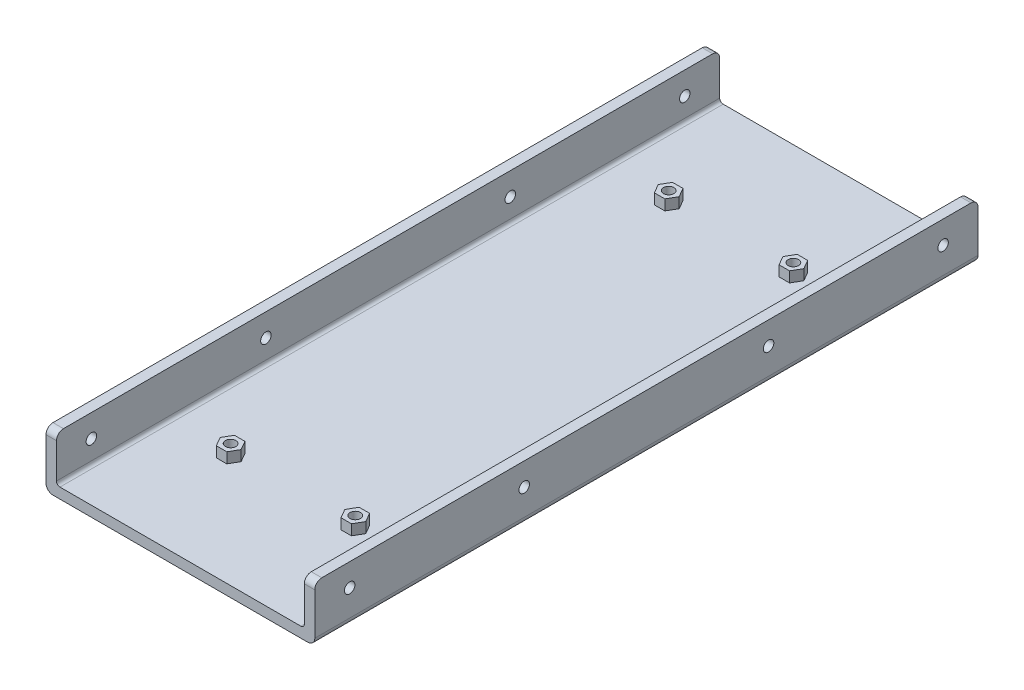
from build123d import *

# Parameters (mm, degrees)
EXTRUDE_1_DEPTH     = 190
FILLET_1_R          = 2
FILLET_2_R          = 1
CUT_EXTRUDE_1_REACH = 209.392
SKETCH_10_R         = 1.5
SKETCH_12_R         = 1.5
EXTRUDE_3_DEPTH     = 3
CUT_EXTRUDE_START   = -33
SKETCH_14_R         = 1.5
CUT_EXTRUDE_3_DEPTH = 33
FILLET_3_R          = 2


with BuildPart() as part:
    # Sketch 7 → Extrude 1 (new body)
    with BuildSketch(Plane.XY):
        Polygon((49.522641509, -31.340644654), (49.522641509, -15.340644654), (46.522641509, -15.340644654), (46.522641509, -28.340644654), (-24.477358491, -28.340644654), (-24.477358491, -15.340644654), (-27.477358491, -15.340644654), (-27.477358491, -31.340644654), align=None)
    extrude(amount=EXTRUDE_1_DEPTH)

    # Fillet 1
    fillet_1_edges = [part.edges().sort_by_distance(p)[0] for p in [
        (-27.477358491, -31.340644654, 95),
        (49.522641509, -31.340644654, 95),
    ]]
    fillet(fillet_1_edges, radius=FILLET_1_R)

    # Fillet 2
    fillet_2_edges = [part.edges().sort_by_distance(p)[0] for p in [
        (-24.477358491, -28.340644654, 95),
        (46.522641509, -28.340644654, 95),
    ]]
    fillet(fillet_2_edges, radius=FILLET_2_R)

    # Cut-Extrude 1: up to this face of the body (flat: up to its plane)
    cut_extrude_1_end = Plane(part.part.faces().sort_by_distance((-27.477358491, -22.340644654, 95))[0])
    # Sketch 10 → Cut-Extrude 1 (cut, up to the picked face)
    with BuildSketch(Plane.ZY.offset(-49.522641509), mode=Mode.PRIVATE) as cut_extrude_1_sk1:
        with Locations(Location((10, -21.840644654, 0), (0, 0, 180))):
            Circle(SKETCH_10_R)
    cut_extrude_1_tool1 = split(extrude(cut_extrude_1_sk1.sketch, amount=CUT_EXTRUDE_1_REACH, mode=Mode.PRIVATE), bisect_by=cut_extrude_1_end, keep=Keep.BOTH, mode=Mode.PRIVATE)
    # Sketch 10 → Cut-Extrude 1 (cut, up to the picked face)
    with BuildSketch(Plane.ZY.offset(-49.522641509), mode=Mode.PRIVATE) as cut_extrude_1_sk2:
        with Locations(Location((60, -21.840644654, 0), (0, 0, 180))):
            Circle(SKETCH_10_R)
    cut_extrude_1_tool2 = split(extrude(cut_extrude_1_sk2.sketch, amount=CUT_EXTRUDE_1_REACH, mode=Mode.PRIVATE), bisect_by=cut_extrude_1_end, keep=Keep.BOTH, mode=Mode.PRIVATE)
    # Sketch 10 → Cut-Extrude 1 (cut, up to the picked face)
    with BuildSketch(Plane.ZY.offset(-49.522641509), mode=Mode.PRIVATE) as cut_extrude_1_sk3:
        with Locations(Location((130, -21.840644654, 0), (0, 0, 180))):
            Circle(SKETCH_10_R)
    cut_extrude_1_tool3 = split(extrude(cut_extrude_1_sk3.sketch, amount=CUT_EXTRUDE_1_REACH, mode=Mode.PRIVATE), bisect_by=cut_extrude_1_end, keep=Keep.BOTH, mode=Mode.PRIVATE)
    # Sketch 10 → Cut-Extrude 1 (cut, up to the picked face)
    with BuildSketch(Plane.ZY.offset(-49.522641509), mode=Mode.PRIVATE) as cut_extrude_1_sk4:
        with Locations(Location((180, -21.840644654, 0), (0, 0, 180))):
            Circle(SKETCH_10_R)
    cut_extrude_1_tool4 = split(extrude(cut_extrude_1_sk4.sketch, amount=CUT_EXTRUDE_1_REACH, mode=Mode.PRIVATE), bisect_by=cut_extrude_1_end, keep=Keep.BOTH, mode=Mode.PRIVATE)
    add(cut_extrude_1_tool1.solids().sort_by(Axis((49.522642, -21.840645, 10), (-1, 0, 0)))[0], mode=Mode.SUBTRACT)
    add(cut_extrude_1_tool2.solids().sort_by(Axis((49.522642, -21.840645, 60), (-1, 0, 0)))[0], mode=Mode.SUBTRACT)
    add(cut_extrude_1_tool3.solids().sort_by(Axis((49.522642, -21.840645, 130), (-1, 0, 0)))[0], mode=Mode.SUBTRACT)
    add(cut_extrude_1_tool4.solids().sort_by(Axis((49.522642, -21.840645, 180), (-1, 0, 0)))[0], mode=Mode.SUBTRACT)

    # Sketch 12 → Extrude 3 (add)
    # profile 1 of 4: a face of its own
    with BuildSketch(Plane(origin=(0, -28.340644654, 0), x_dir=(1, 0, 0), z_dir=(0, 1, 0))):
        Polygon((25.882256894, -157.75), (27.382256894, -160.348076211), (30.382256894, -160.348076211), (31.882256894, -157.75), (30.382256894, -155.151923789), (27.382256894, -155.151923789), align=None)
        with Locations(Location((28.882256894, -157.75, 0), (0, 0, 270))):
            Circle(SKETCH_12_R, mode=Mode.SUBTRACT)
    # profile 2 of 4: a face of its own
    with BuildSketch(Plane(origin=(0, -28.340644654, 0), x_dir=(1, 0, 0), z_dir=(0, 1, 0))):
        Polygon((-5.336973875, -155.151923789), (-3.836973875, -157.75), (-5.336973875, -160.348076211), (-8.336973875, -160.348076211), (-9.836973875, -157.75), (-8.336973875, -155.151923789), align=None)
        with Locations(Location((-6.836973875, -157.75, 0), (0, 0, 90))):
            Circle(SKETCH_12_R, mode=Mode.SUBTRACT)
    # profile 3 of 4: a face of its own
    with BuildSketch(Plane(origin=(0, -28.340644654, 0), x_dir=(1, 0, 0), z_dir=(0, 1, 0))):
        Polygon((-3.836973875, -32.25), (-5.336973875, -29.651923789), (-8.336973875, -29.651923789), (-9.836973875, -32.25), (-8.336973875, -34.848076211), (-5.336973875, -34.848076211), align=None)
        with Locations(Location((-6.836973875, -32.25, 0), (0, 0, 270))):
            Circle(SKETCH_12_R, mode=Mode.SUBTRACT)
    # profile 4 of 4: a face of its own
    with BuildSketch(Plane(origin=(0, -28.340644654, 0), x_dir=(1, 0, 0), z_dir=(0, 1, 0))):
        Polygon((27.382256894, -34.848076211), (25.882256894, -32.25), (27.382256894, -29.651923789), (30.382256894, -29.651923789), (31.882256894, -32.25), (30.382256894, -34.848076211), align=None)
        with Locations(Location((28.882256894, -32.25, 0), (0, 0, 90))):
            Circle(SKETCH_12_R, mode=Mode.SUBTRACT)
    extrude(amount=EXTRUDE_3_DEPTH)

    # Sketch 14 → Cut-Extrude 3 (cut)
    with BuildSketch(Plane(origin=(0, -25.340644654, 0), x_dir=(1, 0, 0), z_dir=(0, 1, 0)).offset(CUT_EXTRUDE_START)):
        with Locations(Location((28.882256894, -157.75, 0), (0, 0, 270))):
            Circle(SKETCH_14_R)
        with Locations(Location((-6.836973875, -157.75, 0), (0, 0, 90))):
            Circle(SKETCH_14_R)
        with Locations(Location((28.882256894, -32.25, 0), (0, 0, 90))):
            Circle(SKETCH_14_R)
        with Locations(Location((-6.836973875, -32.25, 0), (0, 0, 270))):
            Circle(SKETCH_14_R)
    extrude(amount=CUT_EXTRUDE_3_DEPTH, mode=Mode.SUBTRACT)

    # Fillet 3
    fillet_3_edges = [part.edges().sort_by_distance(p)[0] for p in [
        (48.022641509, -15.340644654, 190),
        (-25.977358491, -15.340644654, 190),
        (-25.977358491, -15.340644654, 0),
        (48.022641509, -15.340644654, 0),
    ]]
    fillet(fillet_3_edges, radius=FILLET_3_R)


solid = part.part
